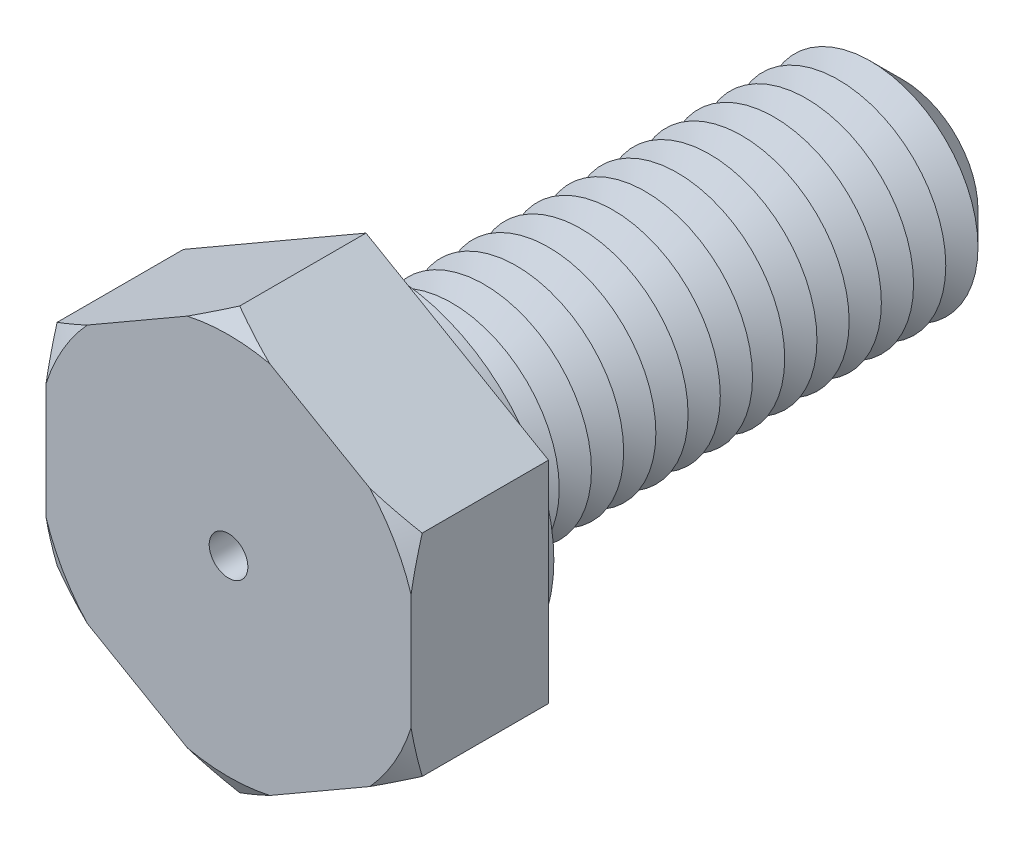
from build123d import *

# Parameters (mm, degrees)
BOSS_EXTRUDE1_DEPTH = 6.4
SKETCH3_R           = 5
BOSS_EXTRUDE2_DEPTH = 25
SKETCH4_R           = 7.75
BOSS_EXTRUDE3_DEPTH = 1
CHAMFER1_SIZE       = 1.5
LPATTERN1_COUNT     = 15
LPATTERN1_PITCH     = 1.5
SKETCH8_R           = 0.9
CUT_EXTRUDE1_DEPTH  = 31.4


with BuildPart() as part:
    # Sketch2 → Boss-Extrude1 (new body)
    with BuildSketch(Plane.XY):
        Polygon((0, 9.814954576), (-8.5, 4.907477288), (-8.5, -4.907477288), (0, -9.814954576), (8.5, -4.907477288), (8.5, 4.907477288), align=None)
    extrude(amount=BOSS_EXTRUDE1_DEPTH)

    # Sketch3 → Boss-Extrude2 (add)
    with BuildSketch(Plane(origin=(0, 0, 0), x_dir=(-1, 0, 0), z_dir=(0, 0, -1))):
        Circle(SKETCH3_R)
    extrude(amount=BOSS_EXTRUDE2_DEPTH)

    # Sketch4 → Boss-Extrude3 (add)
    with BuildSketch(Plane(origin=(0, 0, 0), x_dir=(-1, 0, 0), z_dir=(0, 0, -1))):
        with Locations(Location((0, 0, 0), (0, 0, 180))):
            Circle(SKETCH4_R)
    extrude(amount=BOSS_EXTRUDE3_DEPTH)

    # Chamfer1
    chamfer1_edges = [part.edges().sort_by_distance(p)[0] for p in [
        (5, 0, -25),
    ]]
    chamfer(chamfer1_edges, length=CHAMFER1_SIZE)

    # Sketch6 → Cut-Revolve1 (revolve, cut)
    with BuildSketch(Plane(origin=(0, 0, 0), x_dir=(0, 0, -1), z_dir=(1, 0, 0)), mode=Mode.PRIVATE) as cut_revolve1_sk:
        Polygon((1, 5), (1.75, 3.700961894), (2.5, 5), align=None)
    cut_revolve1 = revolve(cut_revolve1_sk.sketch.rotate(Axis((0, 0, 3.211670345), (0, 0, -1)), 90), axis=Axis((0, 0, 3.211670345), (0, 0, -1)), mode=Mode.SUBTRACT)

    # LPattern1: Cut-Revolve1 ×15
    with Locations(*[(0, 0, -i * LPATTERN1_PITCH) for i in range(1, LPATTERN1_COUNT)]):
        add(cut_revolve1, mode=Mode.SUBTRACT)

    # Sketch7 → Cut-Revolve2 (revolve, cut)
    with BuildSketch(Plane(origin=(0, 0, 0), x_dir=(0, 0, -1), z_dir=(1, 0, 0)), mode=Mode.PRIVATE) as cut_revolve2_sk:
        Polygon((-6.4, 9.814954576), (-6.4, 8.914954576), (-5.880384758, 9.814954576), align=None)
    revolve(cut_revolve2_sk.sketch.rotate(Axis((0, 0, 3.211670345), (0, 0, -1)), 90), axis=Axis((0, 0, 3.211670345), (0, 0, -1)), mode=Mode.SUBTRACT)

    # Sketch8 → Cut-Extrude1 (cut)
    with BuildSketch(Plane.XY.offset(6.4)):
        Circle(SKETCH8_R)
    extrude(amount=-CUT_EXTRUDE1_DEPTH, mode=Mode.SUBTRACT)


solid = part.part
